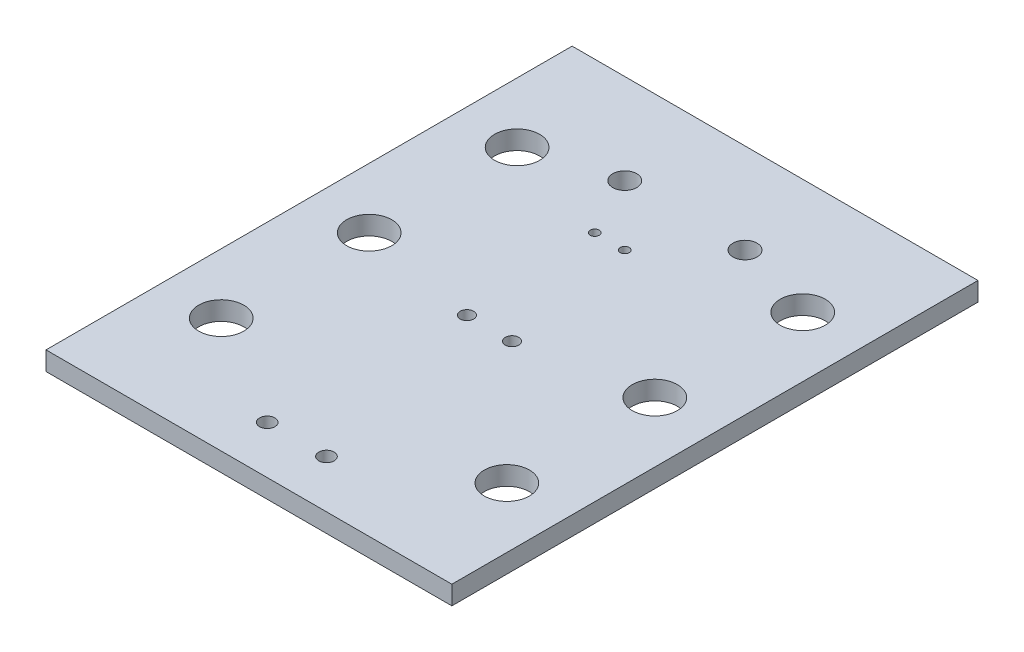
ISO-10303-21;
HEADER;
FILE_DESCRIPTION(('STEP AP214'),'2;1');
FILE_NAME('part.step','',(''),(''),'','','');
FILE_SCHEMA(('AUTOMOTIVE_DESIGN { 1 0 10303 214 1 1 1 1 }'));
ENDSEC;
DATA;
#1=APPLICATION_CONTEXT('core data for automotive mechanical design processes');
#2=APPLICATION_PROTOCOL_DEFINITION('international standard','automotive_design',2000,#1);
#3=PRODUCT_CONTEXT('',#1,'mechanical');
#4=PRODUCT('Part','Part','',(#3));
#5=PRODUCT_RELATED_PRODUCT_CATEGORY('part','',(#4));
#6=PRODUCT_DEFINITION_FORMATION('','',#4);
#7=PRODUCT_DEFINITION_CONTEXT('part definition',#1,'design');
#8=PRODUCT_DEFINITION('design','',#6,#7);
#9=PRODUCT_DEFINITION_SHAPE('','',#8);
#10=(LENGTH_UNIT() NAMED_UNIT(*) SI_UNIT(.MILLI.,.METRE.));
#11=(NAMED_UNIT(*) PLANE_ANGLE_UNIT() SI_UNIT($,.RADIAN.));
#12=(NAMED_UNIT(*) SI_UNIT($,.STERADIAN.) SOLID_ANGLE_UNIT());
#13=UNCERTAINTY_MEASURE_WITH_UNIT(LENGTH_MEASURE(1.E-05),#10,'distance_accuracy_value','');
#14=(GEOMETRIC_REPRESENTATION_CONTEXT(3) GLOBAL_UNCERTAINTY_ASSIGNED_CONTEXT((#13)) GLOBAL_UNIT_ASSIGNED_CONTEXT((#10,
#11,#12)) REPRESENTATION_CONTEXT('',''));
#15=CARTESIAN_POINT('',(0.,0.,0.));
#16=DIRECTION('',(0.,0.,1.));
#17=DIRECTION('',(1.,0.,0.));
#18=AXIS2_PLACEMENT_3D('',#15,#16,#17);
#19=CARTESIAN_POINT('',(-17.145,1.5875,-44.45));
#20=DIRECTION('',(1.,0.,0.));
#21=DIRECTION('',(0.,0.,-1.));
#22=AXIS2_PLACEMENT_3D('',#19,#20,#21);
#23=PLANE('',#22);
#24=DIRECTION('',(0.,0.,1.));
#25=VECTOR('',#24,1.);
#26=CARTESIAN_POINT('',(-17.145,0.,-44.45));
#27=LINE('',#26,#25);
#28=CARTESIAN_POINT('',(-17.145,0.,-44.45));
#29=VERTEX_POINT('',#28);
#30=CARTESIAN_POINT('',(-17.145,0.,0.));
#31=VERTEX_POINT('',#30);
#32=EDGE_CURVE('E96',#29,#31,#27,.T.);
#33=ORIENTED_EDGE('',*,*,#32,.T.);
#34=DIRECTION('',(0.,-1.,0.));
#35=VECTOR('',#34,1.);
#36=CARTESIAN_POINT('',(-17.145,1.5875,0.));
#37=LINE('',#36,#35);
#38=CARTESIAN_POINT('',(-17.145,1.5875,0.));
#39=VERTEX_POINT('',#38);
#40=EDGE_CURVE('E11',#39,#31,#37,.T.);
#41=ORIENTED_EDGE('',*,*,#40,.F.);
#42=DIRECTION('',(0.,0.,1.));
#43=VECTOR('',#42,1.);
#44=CARTESIAN_POINT('',(-17.145,1.5875,-44.45));
#45=LINE('',#44,#43);
#46=CARTESIAN_POINT('',(-17.145,1.5875,-44.45));
#47=VERTEX_POINT('',#46);
#48=EDGE_CURVE('E84',#47,#39,#45,.T.);
#49=ORIENTED_EDGE('',*,*,#48,.F.);
#50=DIRECTION('',(0.,-1.,0.));
#51=VECTOR('',#50,1.);
#52=CARTESIAN_POINT('',(-17.145,1.5875,-44.45));
#53=LINE('',#52,#51);
#54=EDGE_CURVE('E92',#47,#29,#53,.T.);
#55=ORIENTED_EDGE('',*,*,#54,.T.);
#56=EDGE_LOOP('',(#33,#41,#49,#55));
#57=FACE_BOUND('',#56,.T.);
#58=ADVANCED_FACE('F33',(#57),#23,.F.);
#59=CARTESIAN_POINT('',(-17.145,1.5875,0.));
#60=DIRECTION('',(0.,0.,-1.));
#61=DIRECTION('',(-1.,0.,0.));
#62=AXIS2_PLACEMENT_3D('',#59,#60,#61);
#63=PLANE('',#62);
#64=DIRECTION('',(1.,0.,0.));
#65=VECTOR('',#64,1.);
#66=CARTESIAN_POINT('',(-17.145,0.,0.));
#67=LINE('',#66,#65);
#68=CARTESIAN_POINT('',(17.145,0.,0.));
#69=VERTEX_POINT('',#68);
#70=EDGE_CURVE('E88',#31,#69,#67,.T.);
#71=ORIENTED_EDGE('',*,*,#70,.T.);
#72=DIRECTION('',(0.,-1.,0.));
#73=VECTOR('',#72,1.);
#74=CARTESIAN_POINT('',(17.145,1.5875,0.));
#75=LINE('',#74,#73);
#76=CARTESIAN_POINT('',(17.145,1.5875,0.));
#77=VERTEX_POINT('',#76);
#78=EDGE_CURVE('E41',#77,#69,#75,.T.);
#79=ORIENTED_EDGE('',*,*,#78,.F.);
#80=DIRECTION('',(1.,0.,0.));
#81=VECTOR('',#80,1.);
#82=CARTESIAN_POINT('',(-17.145,1.5875,0.));
#83=LINE('',#82,#81);
#84=EDGE_CURVE('E79',#39,#77,#83,.T.);
#85=ORIENTED_EDGE('',*,*,#84,.F.);
#86=ORIENTED_EDGE('',*,*,#40,.T.);
#87=EDGE_LOOP('',(#71,#79,#85,#86));
#88=FACE_BOUND('',#87,.T.);
#89=ADVANCED_FACE('F87',(#88),#63,.F.);
#90=CARTESIAN_POINT('',(17.145,1.5875,-44.45));
#91=DIRECTION('',(-1.,0.,0.));
#92=DIRECTION('',(0.,0.,1.));
#93=AXIS2_PLACEMENT_3D('',#90,#91,#92);
#94=PLANE('',#93);
#95=DIRECTION('',(0.,0.,-1.));
#96=VECTOR('',#95,1.);
#97=CARTESIAN_POINT('',(17.145,0.,-44.45));
#98=LINE('',#97,#96);
#99=CARTESIAN_POINT('',(17.145,0.,-44.45));
#100=VERTEX_POINT('',#99);
#101=EDGE_CURVE('E66',#69,#100,#98,.T.);
#102=ORIENTED_EDGE('',*,*,#101,.T.);
#103=DIRECTION('',(0.,-1.,0.));
#104=VECTOR('',#103,1.);
#105=CARTESIAN_POINT('',(17.145,1.5875,-44.45));
#106=LINE('',#105,#104);
#107=CARTESIAN_POINT('',(17.145,1.5875,-44.45));
#108=VERTEX_POINT('',#107);
#109=EDGE_CURVE('E89',#108,#100,#106,.T.);
#110=ORIENTED_EDGE('',*,*,#109,.F.);
#111=DIRECTION('',(0.,0.,-1.));
#112=VECTOR('',#111,1.);
#113=CARTESIAN_POINT('',(17.145,1.5875,-44.45));
#114=LINE('',#113,#112);
#115=EDGE_CURVE('E82',#77,#108,#114,.T.);
#116=ORIENTED_EDGE('',*,*,#115,.F.);
#117=ORIENTED_EDGE('',*,*,#78,.T.);
#118=EDGE_LOOP('',(#102,#110,#116,#117));
#119=FACE_BOUND('',#118,.T.);
#120=ADVANCED_FACE('F90',(#119),#94,.F.);
#121=CARTESIAN_POINT('',(-17.145,1.5875,-44.45));
#122=DIRECTION('',(0.,0.,1.));
#123=DIRECTION('',(1.,0.,0.));
#124=AXIS2_PLACEMENT_3D('',#121,#122,#123);
#125=PLANE('',#124);
#126=DIRECTION('',(-1.,0.,0.));
#127=VECTOR('',#126,1.);
#128=CARTESIAN_POINT('',(-17.145,0.,-44.45));
#129=LINE('',#128,#127);
#130=EDGE_CURVE('E72',#100,#29,#129,.T.);
#131=ORIENTED_EDGE('',*,*,#130,.T.);
#132=ORIENTED_EDGE('',*,*,#54,.F.);
#133=DIRECTION('',(-1.,0.,0.));
#134=VECTOR('',#133,1.);
#135=CARTESIAN_POINT('',(-17.145,1.5875,-44.45));
#136=LINE('',#135,#134);
#137=EDGE_CURVE('E49',#108,#47,#136,.T.);
#138=ORIENTED_EDGE('',*,*,#137,.F.);
#139=ORIENTED_EDGE('',*,*,#109,.T.);
#140=EDGE_LOOP('',(#131,#132,#138,#139));
#141=FACE_BOUND('',#140,.T.);
#142=ADVANCED_FACE('F104',(#141),#125,.F.);
#143=CARTESIAN_POINT('',(0.,1.5875,0.));
#144=DIRECTION('',(0.,1.,0.));
#145=DIRECTION('',(0.,0.,1.));
#146=AXIS2_PLACEMENT_3D('',#143,#144,#145);
#147=PLANE('',#146);
#148=CARTESIAN_POINT('',(-5.08,1.5875,-36.83));
#149=DIRECTION('',(0.,1.,0.));
#150=DIRECTION('',(0.,0.,-1.));
#151=AXIS2_PLACEMENT_3D('',#148,#149,#150);
#152=CIRCLE('',#151,1.016);
#153=CARTESIAN_POINT('',(-5.08,1.5875,-37.846));
#154=VERTEX_POINT('',#153);
#155=EDGE_CURVE('E188',#154,#154,#152,.T.);
#156=ORIENTED_EDGE('',*,*,#155,.F.);
#157=EDGE_LOOP('',(#156));
#158=FACE_BOUND('',#157,.T.);
#159=CARTESIAN_POINT('',(-12.065,1.5875,-34.7218));
#160=DIRECTION('',(0.,1.,0.));
#161=DIRECTION('',(0.,0.,-1.));
#162=AXIS2_PLACEMENT_3D('',#159,#160,#161);
#163=CIRCLE('',#162,1.905);
#164=CARTESIAN_POINT('',(-12.065,1.5875,-36.6268));
#165=VERTEX_POINT('',#164);
#166=EDGE_CURVE('E182',#165,#165,#163,.T.);
#167=ORIENTED_EDGE('',*,*,#166,.F.);
#168=EDGE_LOOP('',(#167));
#169=FACE_BOUND('',#168,.T.);
#170=CARTESIAN_POINT('',(-1.905,1.5875,-20.32));
#171=DIRECTION('',(0.,1.,0.));
#172=DIRECTION('',(0.,0.,-1.));
#173=AXIS2_PLACEMENT_3D('',#170,#171,#172);
#174=CIRCLE('',#173,0.5715);
#175=CARTESIAN_POINT('',(-1.905,1.5875,-20.8915));
#176=VERTEX_POINT('',#175);
#177=EDGE_CURVE('E176',#176,#176,#174,.T.);
#178=ORIENTED_EDGE('',*,*,#177,.F.);
#179=EDGE_LOOP('',(#178));
#180=FACE_BOUND('',#179,.T.);
#181=CARTESIAN_POINT('',(-12.065,1.5875,-22.225));
#182=DIRECTION('',(0.,1.,0.));
#183=DIRECTION('',(0.,0.,-1.));
#184=AXIS2_PLACEMENT_3D('',#181,#182,#183);
#185=CIRCLE('',#184,1.905);
#186=CARTESIAN_POINT('',(-12.065,1.5875,-24.13));
#187=VERTEX_POINT('',#186);
#188=EDGE_CURVE('E170',#187,#187,#185,.T.);
#189=ORIENTED_EDGE('',*,*,#188,.F.);
#190=EDGE_LOOP('',(#189));
#191=FACE_BOUND('',#190,.T.);
#192=CARTESIAN_POINT('',(-2.5019,1.5875,-4.04876));
#193=DIRECTION('',(0.,1.,0.));
#194=DIRECTION('',(0.,0.,-1.));
#195=AXIS2_PLACEMENT_3D('',#192,#193,#194);
#196=CIRCLE('',#195,0.6477);
#197=CARTESIAN_POINT('',(-2.5019,1.5875,-4.69646));
#198=VERTEX_POINT('',#197);
#199=EDGE_CURVE('E164',#198,#198,#196,.T.);
#200=ORIENTED_EDGE('',*,*,#199,.F.);
#201=EDGE_LOOP('',(#200));
#202=FACE_BOUND('',#201,.T.);
#203=CARTESIAN_POINT('',(-12.065,1.5875,-9.72566));
#204=DIRECTION('',(0.,1.,0.));
#205=DIRECTION('',(0.,0.,-1.));
#206=AXIS2_PLACEMENT_3D('',#203,#204,#205);
#207=CIRCLE('',#206,1.905);
#208=CARTESIAN_POINT('',(-12.065,1.5875,-11.63066));
#209=VERTEX_POINT('',#208);
#210=EDGE_CURVE('E158',#209,#209,#207,.T.);
#211=ORIENTED_EDGE('',*,*,#210,.F.);
#212=EDGE_LOOP('',(#211));
#213=FACE_BOUND('',#212,.T.);
#214=CARTESIAN_POINT('',(5.08,1.5875,-36.83));
#215=DIRECTION('',(0.,1.,0.));
#216=DIRECTION('',(0.,0.,1.));
#217=AXIS2_PLACEMENT_3D('',#214,#215,#216);
#218=CIRCLE('',#217,1.016);
#219=CARTESIAN_POINT('',(5.08,1.5875,-35.814));
#220=VERTEX_POINT('',#219);
#221=EDGE_CURVE('E152',#220,#220,#218,.T.);
#222=ORIENTED_EDGE('',*,*,#221,.F.);
#223=EDGE_LOOP('',(#222));
#224=FACE_BOUND('',#223,.T.);
#225=CARTESIAN_POINT('',(-2.54,1.5875,-31.75));
#226=DIRECTION('',(0.,1.,0.));
#227=DIRECTION('',(0.,0.,1.));
#228=AXIS2_PLACEMENT_3D('',#225,#226,#227);
#229=CIRCLE('',#228,0.381);
#230=CARTESIAN_POINT('',(-2.54,1.5875,-31.369));
#231=VERTEX_POINT('',#230);
#232=EDGE_CURVE('E146',#231,#231,#229,.T.);
#233=ORIENTED_EDGE('',*,*,#232,.F.);
#234=EDGE_LOOP('',(#233));
#235=FACE_BOUND('',#234,.T.);
#236=CARTESIAN_POINT('',(0.,1.5875,-31.75));
#237=DIRECTION('',(0.,1.,0.));
#238=DIRECTION('',(0.,0.,1.));
#239=AXIS2_PLACEMENT_3D('',#236,#237,#238);
#240=CIRCLE('',#239,0.381);
#241=CARTESIAN_POINT('',(0.,1.5875,-31.369));
#242=VERTEX_POINT('',#241);
#243=EDGE_CURVE('E140',#242,#242,#240,.T.);
#244=ORIENTED_EDGE('',*,*,#243,.F.);
#245=EDGE_LOOP('',(#244));
#246=FACE_BOUND('',#245,.T.);
#247=CARTESIAN_POINT('',(1.905,1.5875,-20.32));
#248=DIRECTION('',(0.,1.,0.));
#249=DIRECTION('',(0.,0.,1.));
#250=AXIS2_PLACEMENT_3D('',#247,#248,#249);
#251=CIRCLE('',#250,0.5715);
#252=CARTESIAN_POINT('',(1.905,1.5875,-19.7485));
#253=VERTEX_POINT('',#252);
#254=EDGE_CURVE('E134',#253,#253,#251,.T.);
#255=ORIENTED_EDGE('',*,*,#254,.F.);
#256=EDGE_LOOP('',(#255));
#257=FACE_BOUND('',#256,.T.);
#258=CARTESIAN_POINT('',(2.5019,1.5875,-4.04876));
#259=DIRECTION('',(0.,1.,0.));
#260=DIRECTION('',(0.,0.,1.));
#261=AXIS2_PLACEMENT_3D('',#258,#259,#260);
#262=CIRCLE('',#261,0.6477);
#263=CARTESIAN_POINT('',(2.5019,1.5875,-3.40106));
#264=VERTEX_POINT('',#263);
#265=EDGE_CURVE('E128',#264,#264,#262,.T.);
#266=ORIENTED_EDGE('',*,*,#265,.F.);
#267=EDGE_LOOP('',(#266));
#268=FACE_BOUND('',#267,.T.);
#269=CARTESIAN_POINT('',(12.065,1.5875,-9.72566));
#270=DIRECTION('',(0.,1.,0.));
#271=DIRECTION('',(0.,0.,1.));
#272=AXIS2_PLACEMENT_3D('',#269,#270,#271);
#273=CIRCLE('',#272,1.905);
#274=CARTESIAN_POINT('',(12.065,1.5875,-7.82066));
#275=VERTEX_POINT('',#274);
#276=EDGE_CURVE('E122',#275,#275,#273,.T.);
#277=ORIENTED_EDGE('',*,*,#276,.F.);
#278=EDGE_LOOP('',(#277));
#279=FACE_BOUND('',#278,.T.);
#280=CARTESIAN_POINT('',(12.065,1.5875,-22.225));
#281=DIRECTION('',(0.,1.,0.));
#282=DIRECTION('',(0.,0.,1.));
#283=AXIS2_PLACEMENT_3D('',#280,#281,#282);
#284=CIRCLE('',#283,1.905);
#285=CARTESIAN_POINT('',(12.065,1.5875,-20.32));
#286=VERTEX_POINT('',#285);
#287=EDGE_CURVE('E116',#286,#286,#284,.T.);
#288=ORIENTED_EDGE('',*,*,#287,.F.);
#289=EDGE_LOOP('',(#288));
#290=FACE_BOUND('',#289,.T.);
#291=CARTESIAN_POINT('',(12.065,1.5875,-34.7218));
#292=DIRECTION('',(0.,1.,0.));
#293=DIRECTION('',(0.,0.,1.));
#294=AXIS2_PLACEMENT_3D('',#291,#292,#293);
#295=CIRCLE('',#294,1.905);
#296=CARTESIAN_POINT('',(12.065,1.5875,-32.8168));
#297=VERTEX_POINT('',#296);
#298=EDGE_CURVE('E110',#297,#297,#295,.T.);
#299=ORIENTED_EDGE('',*,*,#298,.F.);
#300=EDGE_LOOP('',(#299));
#301=FACE_BOUND('',#300,.T.);
#302=ORIENTED_EDGE('',*,*,#48,.T.);
#303=ORIENTED_EDGE('',*,*,#84,.T.);
#304=ORIENTED_EDGE('',*,*,#115,.T.);
#305=ORIENTED_EDGE('',*,*,#137,.T.);
#306=EDGE_LOOP('',(#302,#303,#304,#305));
#307=FACE_BOUND('',#306,.T.);
#308=ADVANCED_FACE('F80',(#158,#169,#180,#191,#202,#213,#224,#235,#246,#257,#268,#279,#290,#301,
#307),#147,.T.);
#309=CARTESIAN_POINT('',(0.,0.,0.));
#310=DIRECTION('',(0.,1.,0.));
#311=DIRECTION('',(0.,0.,1.));
#312=AXIS2_PLACEMENT_3D('',#309,#310,#311);
#313=PLANE('',#312);
#314=CARTESIAN_POINT('',(-5.08,0.,-36.83));
#315=DIRECTION('',(0.,1.,0.));
#316=DIRECTION('',(0.,0.,-1.));
#317=AXIS2_PLACEMENT_3D('',#314,#315,#316);
#318=CIRCLE('',#317,1.016);
#319=CARTESIAN_POINT('',(-5.08,0.,-37.846));
#320=VERTEX_POINT('',#319);
#321=EDGE_CURVE('E185',#320,#320,#318,.T.);
#322=ORIENTED_EDGE('',*,*,#321,.T.);
#323=EDGE_LOOP('',(#322));
#324=FACE_BOUND('',#323,.T.);
#325=CARTESIAN_POINT('',(-12.065,0.,-34.7218));
#326=DIRECTION('',(0.,1.,0.));
#327=DIRECTION('',(0.,0.,-1.));
#328=AXIS2_PLACEMENT_3D('',#325,#326,#327);
#329=CIRCLE('',#328,1.905);
#330=CARTESIAN_POINT('',(-12.065,0.,-36.6268));
#331=VERTEX_POINT('',#330);
#332=EDGE_CURVE('E179',#331,#331,#329,.T.);
#333=ORIENTED_EDGE('',*,*,#332,.T.);
#334=EDGE_LOOP('',(#333));
#335=FACE_BOUND('',#334,.T.);
#336=CARTESIAN_POINT('',(-1.905,0.,-20.32));
#337=DIRECTION('',(0.,1.,0.));
#338=DIRECTION('',(0.,0.,-1.));
#339=AXIS2_PLACEMENT_3D('',#336,#337,#338);
#340=CIRCLE('',#339,0.5715);
#341=CARTESIAN_POINT('',(-1.905,0.,-20.8915));
#342=VERTEX_POINT('',#341);
#343=EDGE_CURVE('E173',#342,#342,#340,.T.);
#344=ORIENTED_EDGE('',*,*,#343,.T.);
#345=EDGE_LOOP('',(#344));
#346=FACE_BOUND('',#345,.T.);
#347=CARTESIAN_POINT('',(-12.065,0.,-22.225));
#348=DIRECTION('',(0.,1.,0.));
#349=DIRECTION('',(0.,0.,-1.));
#350=AXIS2_PLACEMENT_3D('',#347,#348,#349);
#351=CIRCLE('',#350,1.905);
#352=CARTESIAN_POINT('',(-12.065,0.,-24.13));
#353=VERTEX_POINT('',#352);
#354=EDGE_CURVE('E167',#353,#353,#351,.T.);
#355=ORIENTED_EDGE('',*,*,#354,.T.);
#356=EDGE_LOOP('',(#355));
#357=FACE_BOUND('',#356,.T.);
#358=CARTESIAN_POINT('',(-2.5019,0.,-4.04876));
#359=DIRECTION('',(0.,1.,0.));
#360=DIRECTION('',(0.,0.,-1.));
#361=AXIS2_PLACEMENT_3D('',#358,#359,#360);
#362=CIRCLE('',#361,0.6477);
#363=CARTESIAN_POINT('',(-2.5019,0.,-4.69646));
#364=VERTEX_POINT('',#363);
#365=EDGE_CURVE('E161',#364,#364,#362,.T.);
#366=ORIENTED_EDGE('',*,*,#365,.T.);
#367=EDGE_LOOP('',(#366));
#368=FACE_BOUND('',#367,.T.);
#369=CARTESIAN_POINT('',(-12.065,0.,-9.72566));
#370=DIRECTION('',(0.,1.,0.));
#371=DIRECTION('',(0.,0.,-1.));
#372=AXIS2_PLACEMENT_3D('',#369,#370,#371);
#373=CIRCLE('',#372,1.905);
#374=CARTESIAN_POINT('',(-12.065,0.,-11.63066));
#375=VERTEX_POINT('',#374);
#376=EDGE_CURVE('E155',#375,#375,#373,.T.);
#377=ORIENTED_EDGE('',*,*,#376,.T.);
#378=EDGE_LOOP('',(#377));
#379=FACE_BOUND('',#378,.T.);
#380=CARTESIAN_POINT('',(5.08,0.,-36.83));
#381=DIRECTION('',(0.,1.,0.));
#382=DIRECTION('',(0.,0.,1.));
#383=AXIS2_PLACEMENT_3D('',#380,#381,#382);
#384=CIRCLE('',#383,1.016);
#385=CARTESIAN_POINT('',(5.08,0.,-35.814));
#386=VERTEX_POINT('',#385);
#387=EDGE_CURVE('E149',#386,#386,#384,.T.);
#388=ORIENTED_EDGE('',*,*,#387,.T.);
#389=EDGE_LOOP('',(#388));
#390=FACE_BOUND('',#389,.T.);
#391=CARTESIAN_POINT('',(-2.54,0.,-31.75));
#392=DIRECTION('',(0.,1.,0.));
#393=DIRECTION('',(0.,0.,1.));
#394=AXIS2_PLACEMENT_3D('',#391,#392,#393);
#395=CIRCLE('',#394,0.381);
#396=CARTESIAN_POINT('',(-2.54,0.,-31.369));
#397=VERTEX_POINT('',#396);
#398=EDGE_CURVE('E143',#397,#397,#395,.T.);
#399=ORIENTED_EDGE('',*,*,#398,.T.);
#400=EDGE_LOOP('',(#399));
#401=FACE_BOUND('',#400,.T.);
#402=CARTESIAN_POINT('',(0.,0.,-31.75));
#403=DIRECTION('',(0.,1.,0.));
#404=DIRECTION('',(0.,0.,1.));
#405=AXIS2_PLACEMENT_3D('',#402,#403,#404);
#406=CIRCLE('',#405,0.381);
#407=CARTESIAN_POINT('',(0.,0.,-31.369));
#408=VERTEX_POINT('',#407);
#409=EDGE_CURVE('E137',#408,#408,#406,.T.);
#410=ORIENTED_EDGE('',*,*,#409,.T.);
#411=EDGE_LOOP('',(#410));
#412=FACE_BOUND('',#411,.T.);
#413=CARTESIAN_POINT('',(1.905,0.,-20.32));
#414=DIRECTION('',(0.,1.,0.));
#415=DIRECTION('',(0.,0.,1.));
#416=AXIS2_PLACEMENT_3D('',#413,#414,#415);
#417=CIRCLE('',#416,0.5715);
#418=CARTESIAN_POINT('',(1.905,0.,-19.7485));
#419=VERTEX_POINT('',#418);
#420=EDGE_CURVE('E131',#419,#419,#417,.T.);
#421=ORIENTED_EDGE('',*,*,#420,.T.);
#422=EDGE_LOOP('',(#421));
#423=FACE_BOUND('',#422,.T.);
#424=CARTESIAN_POINT('',(2.5019,0.,-4.04876));
#425=DIRECTION('',(0.,1.,0.));
#426=DIRECTION('',(0.,0.,1.));
#427=AXIS2_PLACEMENT_3D('',#424,#425,#426);
#428=CIRCLE('',#427,0.6477);
#429=CARTESIAN_POINT('',(2.5019,0.,-3.40106));
#430=VERTEX_POINT('',#429);
#431=EDGE_CURVE('E125',#430,#430,#428,.T.);
#432=ORIENTED_EDGE('',*,*,#431,.T.);
#433=EDGE_LOOP('',(#432));
#434=FACE_BOUND('',#433,.T.);
#435=CARTESIAN_POINT('',(12.065,0.,-9.72566));
#436=DIRECTION('',(0.,1.,0.));
#437=DIRECTION('',(0.,0.,1.));
#438=AXIS2_PLACEMENT_3D('',#435,#436,#437);
#439=CIRCLE('',#438,1.905);
#440=CARTESIAN_POINT('',(12.065,0.,-7.82066));
#441=VERTEX_POINT('',#440);
#442=EDGE_CURVE('E119',#441,#441,#439,.T.);
#443=ORIENTED_EDGE('',*,*,#442,.T.);
#444=EDGE_LOOP('',(#443));
#445=FACE_BOUND('',#444,.T.);
#446=CARTESIAN_POINT('',(12.065,0.,-22.225));
#447=DIRECTION('',(0.,1.,0.));
#448=DIRECTION('',(0.,0.,1.));
#449=AXIS2_PLACEMENT_3D('',#446,#447,#448);
#450=CIRCLE('',#449,1.905);
#451=CARTESIAN_POINT('',(12.065,0.,-20.32));
#452=VERTEX_POINT('',#451);
#453=EDGE_CURVE('E113',#452,#452,#450,.T.);
#454=ORIENTED_EDGE('',*,*,#453,.T.);
#455=EDGE_LOOP('',(#454));
#456=FACE_BOUND('',#455,.T.);
#457=CARTESIAN_POINT('',(12.065,0.,-34.7218));
#458=DIRECTION('',(0.,1.,0.));
#459=DIRECTION('',(0.,0.,1.));
#460=AXIS2_PLACEMENT_3D('',#457,#458,#459);
#461=CIRCLE('',#460,1.905);
#462=CARTESIAN_POINT('',(12.065,0.,-32.8168));
#463=VERTEX_POINT('',#462);
#464=EDGE_CURVE('E99',#463,#463,#461,.T.);
#465=ORIENTED_EDGE('',*,*,#464,.T.);
#466=EDGE_LOOP('',(#465));
#467=FACE_BOUND('',#466,.T.);
#468=ORIENTED_EDGE('',*,*,#32,.F.);
#469=ORIENTED_EDGE('',*,*,#130,.F.);
#470=ORIENTED_EDGE('',*,*,#101,.F.);
#471=ORIENTED_EDGE('',*,*,#70,.F.);
#472=EDGE_LOOP('',(#468,#469,#470,#471));
#473=FACE_BOUND('',#472,.T.);
#474=ADVANCED_FACE('F107',(#324,#335,#346,#357,#368,#379,#390,#401,#412,#423,#434,#445,#456,
#467,#473),#313,.F.);
#475=CARTESIAN_POINT('',(12.065,0.,-34.7218));
#476=DIRECTION('',(0.,1.,0.));
#477=DIRECTION('',(0.,0.,1.));
#478=AXIS2_PLACEMENT_3D('',#475,#476,#477);
#479=CYLINDRICAL_SURFACE('',#478,1.905);
#480=ORIENTED_EDGE('',*,*,#464,.F.);
#481=EDGE_LOOP('',(#480));
#482=FACE_BOUND('',#481,.T.);
#483=ORIENTED_EDGE('',*,*,#298,.T.);
#484=EDGE_LOOP('',(#483));
#485=FACE_BOUND('',#484,.T.);
#486=ADVANCED_FACE('F232',(#482,#485),#479,.F.);
#487=CARTESIAN_POINT('',(12.065,0.,-22.225));
#488=DIRECTION('',(0.,1.,0.));
#489=DIRECTION('',(0.,0.,1.));
#490=AXIS2_PLACEMENT_3D('',#487,#488,#489);
#491=CYLINDRICAL_SURFACE('',#490,1.905);
#492=ORIENTED_EDGE('',*,*,#453,.F.);
#493=EDGE_LOOP('',(#492));
#494=FACE_BOUND('',#493,.T.);
#495=ORIENTED_EDGE('',*,*,#287,.T.);
#496=EDGE_LOOP('',(#495));
#497=FACE_BOUND('',#496,.T.);
#498=ADVANCED_FACE('F234',(#494,#497),#491,.F.);
#499=CARTESIAN_POINT('',(12.065,0.,-9.72566));
#500=DIRECTION('',(0.,1.,0.));
#501=DIRECTION('',(0.,0.,1.));
#502=AXIS2_PLACEMENT_3D('',#499,#500,#501);
#503=CYLINDRICAL_SURFACE('',#502,1.905);
#504=ORIENTED_EDGE('',*,*,#442,.F.);
#505=EDGE_LOOP('',(#504));
#506=FACE_BOUND('',#505,.T.);
#507=ORIENTED_EDGE('',*,*,#276,.T.);
#508=EDGE_LOOP('',(#507));
#509=FACE_BOUND('',#508,.T.);
#510=ADVANCED_FACE('F241',(#506,#509),#503,.F.);
#511=CARTESIAN_POINT('',(2.5019,0.,-4.04876));
#512=DIRECTION('',(0.,1.,0.));
#513=DIRECTION('',(0.,0.,1.));
#514=AXIS2_PLACEMENT_3D('',#511,#512,#513);
#515=CYLINDRICAL_SURFACE('',#514,0.6477);
#516=ORIENTED_EDGE('',*,*,#431,.F.);
#517=EDGE_LOOP('',(#516));
#518=FACE_BOUND('',#517,.T.);
#519=ORIENTED_EDGE('',*,*,#265,.T.);
#520=EDGE_LOOP('',(#519));
#521=FACE_BOUND('',#520,.T.);
#522=ADVANCED_FACE('F287',(#518,#521),#515,.F.);
#523=CARTESIAN_POINT('',(1.905,0.,-20.32));
#524=DIRECTION('',(0.,1.,0.));
#525=DIRECTION('',(0.,0.,1.));
#526=AXIS2_PLACEMENT_3D('',#523,#524,#525);
#527=CYLINDRICAL_SURFACE('',#526,0.5715);
#528=ORIENTED_EDGE('',*,*,#420,.F.);
#529=EDGE_LOOP('',(#528));
#530=FACE_BOUND('',#529,.T.);
#531=ORIENTED_EDGE('',*,*,#254,.T.);
#532=EDGE_LOOP('',(#531));
#533=FACE_BOUND('',#532,.T.);
#534=ADVANCED_FACE('F297',(#530,#533),#527,.F.);
#535=CARTESIAN_POINT('',(0.,0.,-31.75));
#536=DIRECTION('',(0.,1.,0.));
#537=DIRECTION('',(0.,0.,1.));
#538=AXIS2_PLACEMENT_3D('',#535,#536,#537);
#539=CYLINDRICAL_SURFACE('',#538,0.381);
#540=ORIENTED_EDGE('',*,*,#409,.F.);
#541=EDGE_LOOP('',(#540));
#542=FACE_BOUND('',#541,.T.);
#543=ORIENTED_EDGE('',*,*,#243,.T.);
#544=EDGE_LOOP('',(#543));
#545=FACE_BOUND('',#544,.T.);
#546=ADVANCED_FACE('F307',(#542,#545),#539,.F.);
#547=CARTESIAN_POINT('',(-2.54,0.,-31.75));
#548=DIRECTION('',(0.,1.,0.));
#549=DIRECTION('',(0.,0.,1.));
#550=AXIS2_PLACEMENT_3D('',#547,#548,#549);
#551=CYLINDRICAL_SURFACE('',#550,0.381);
#552=ORIENTED_EDGE('',*,*,#398,.F.);
#553=EDGE_LOOP('',(#552));
#554=FACE_BOUND('',#553,.T.);
#555=ORIENTED_EDGE('',*,*,#232,.T.);
#556=EDGE_LOOP('',(#555));
#557=FACE_BOUND('',#556,.T.);
#558=ADVANCED_FACE('F317',(#554,#557),#551,.F.);
#559=CARTESIAN_POINT('',(5.08,0.,-36.83));
#560=DIRECTION('',(0.,1.,0.));
#561=DIRECTION('',(0.,0.,1.));
#562=AXIS2_PLACEMENT_3D('',#559,#560,#561);
#563=CYLINDRICAL_SURFACE('',#562,1.016);
#564=ORIENTED_EDGE('',*,*,#387,.F.);
#565=EDGE_LOOP('',(#564));
#566=FACE_BOUND('',#565,.T.);
#567=ORIENTED_EDGE('',*,*,#221,.T.);
#568=EDGE_LOOP('',(#567));
#569=FACE_BOUND('',#568,.T.);
#570=ADVANCED_FACE('F327',(#566,#569),#563,.F.);
#571=CARTESIAN_POINT('',(-12.065,0.,-9.72566));
#572=DIRECTION('',(0.,1.,0.));
#573=DIRECTION('',(0.,0.,1.));
#574=AXIS2_PLACEMENT_3D('',#571,#572,#573);
#575=CYLINDRICAL_SURFACE('',#574,1.905);
#576=ORIENTED_EDGE('',*,*,#376,.F.);
#577=EDGE_LOOP('',(#576));
#578=FACE_BOUND('',#577,.T.);
#579=ORIENTED_EDGE('',*,*,#210,.T.);
#580=EDGE_LOOP('',(#579));
#581=FACE_BOUND('',#580,.T.);
#582=ADVANCED_FACE('F337',(#578,#581),#575,.F.);
#583=CARTESIAN_POINT('',(-2.5019,0.,-4.04876));
#584=DIRECTION('',(0.,1.,0.));
#585=DIRECTION('',(0.,0.,1.));
#586=AXIS2_PLACEMENT_3D('',#583,#584,#585);
#587=CYLINDRICAL_SURFACE('',#586,0.6477);
#588=ORIENTED_EDGE('',*,*,#365,.F.);
#589=EDGE_LOOP('',(#588));
#590=FACE_BOUND('',#589,.T.);
#591=ORIENTED_EDGE('',*,*,#199,.T.);
#592=EDGE_LOOP('',(#591));
#593=FACE_BOUND('',#592,.T.);
#594=ADVANCED_FACE('F347',(#590,#593),#587,.F.);
#595=CARTESIAN_POINT('',(-12.065,0.,-22.225));
#596=DIRECTION('',(0.,1.,0.));
#597=DIRECTION('',(0.,0.,1.));
#598=AXIS2_PLACEMENT_3D('',#595,#596,#597);
#599=CYLINDRICAL_SURFACE('',#598,1.905);
#600=ORIENTED_EDGE('',*,*,#354,.F.);
#601=EDGE_LOOP('',(#600));
#602=FACE_BOUND('',#601,.T.);
#603=ORIENTED_EDGE('',*,*,#188,.T.);
#604=EDGE_LOOP('',(#603));
#605=FACE_BOUND('',#604,.T.);
#606=ADVANCED_FACE('F357',(#602,#605),#599,.F.);
#607=CARTESIAN_POINT('',(-1.905,0.,-20.32));
#608=DIRECTION('',(0.,1.,0.));
#609=DIRECTION('',(0.,0.,1.));
#610=AXIS2_PLACEMENT_3D('',#607,#608,#609);
#611=CYLINDRICAL_SURFACE('',#610,0.5715);
#612=ORIENTED_EDGE('',*,*,#343,.F.);
#613=EDGE_LOOP('',(#612));
#614=FACE_BOUND('',#613,.T.);
#615=ORIENTED_EDGE('',*,*,#177,.T.);
#616=EDGE_LOOP('',(#615));
#617=FACE_BOUND('',#616,.T.);
#618=ADVANCED_FACE('F367',(#614,#617),#611,.F.);
#619=CARTESIAN_POINT('',(-12.065,0.,-34.7218));
#620=DIRECTION('',(0.,1.,0.));
#621=DIRECTION('',(0.,0.,1.));
#622=AXIS2_PLACEMENT_3D('',#619,#620,#621);
#623=CYLINDRICAL_SURFACE('',#622,1.905);
#624=ORIENTED_EDGE('',*,*,#332,.F.);
#625=EDGE_LOOP('',(#624));
#626=FACE_BOUND('',#625,.T.);
#627=ORIENTED_EDGE('',*,*,#166,.T.);
#628=EDGE_LOOP('',(#627));
#629=FACE_BOUND('',#628,.T.);
#630=ADVANCED_FACE('F199',(#626,#629),#623,.F.);
#631=CARTESIAN_POINT('',(-5.08,0.,-36.83));
#632=DIRECTION('',(0.,1.,0.));
#633=DIRECTION('',(0.,0.,1.));
#634=AXIS2_PLACEMENT_3D('',#631,#632,#633);
#635=CYLINDRICAL_SURFACE('',#634,1.016);
#636=ORIENTED_EDGE('',*,*,#321,.F.);
#637=EDGE_LOOP('',(#636));
#638=FACE_BOUND('',#637,.T.);
#639=ORIENTED_EDGE('',*,*,#155,.T.);
#640=EDGE_LOOP('',(#639));
#641=FACE_BOUND('',#640,.T.);
#642=ADVANCED_FACE('F196',(#638,#641),#635,.F.);
#643=CLOSED_SHELL('',(#58,#89,#120,#142,#308,#474,#486,#498,#510,#522,#534,#546,#558,#570,#582,
#594,#606,#618,#630,#642));
#644=MANIFOLD_SOLID_BREP('B2',#643);
#645=ADVANCED_BREP_SHAPE_REPRESENTATION('',(#18,#644),#14);
#646=SHAPE_DEFINITION_REPRESENTATION(#9,#645);
ENDSEC;
END-ISO-10303-21;
